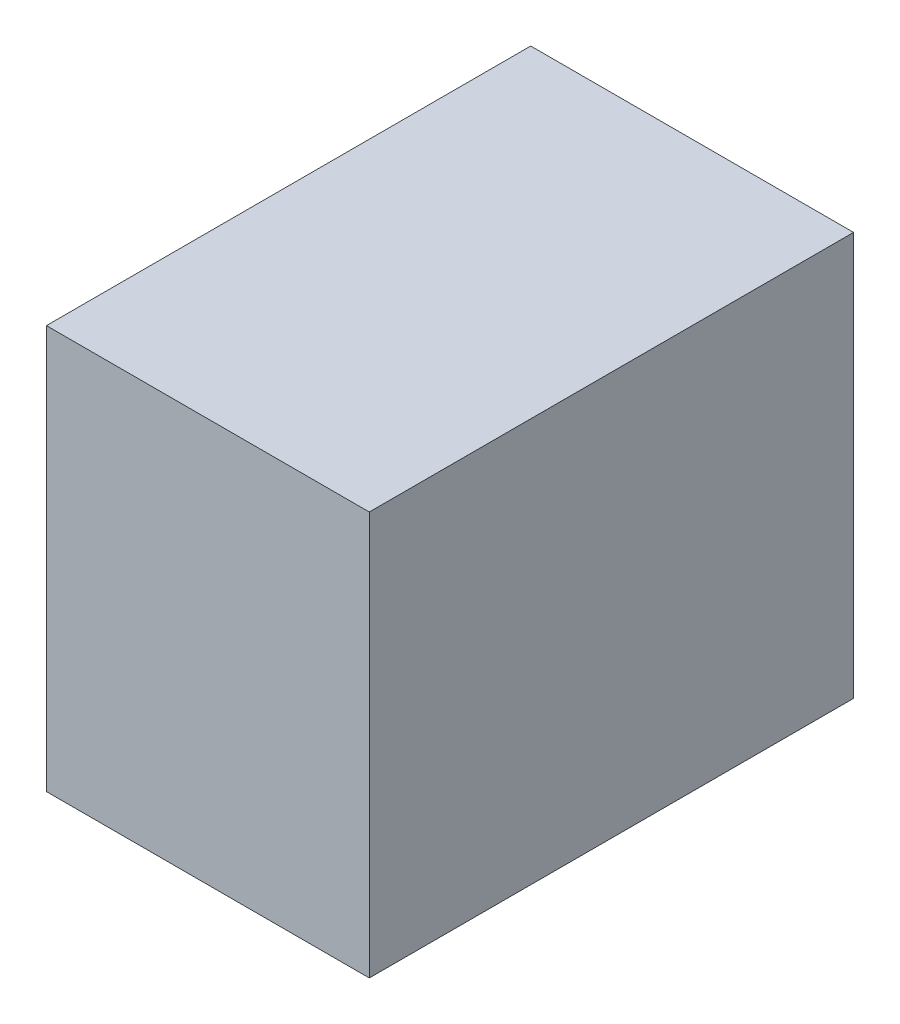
ISO-10303-21;
HEADER;
FILE_DESCRIPTION(('STEP AP214'),'2;1');
FILE_NAME('part.step','',(''),(''),'','','');
FILE_SCHEMA(('AUTOMOTIVE_DESIGN { 1 0 10303 214 1 1 1 1 }'));
ENDSEC;
DATA;
#1=APPLICATION_CONTEXT('core data for automotive mechanical design processes');
#2=APPLICATION_PROTOCOL_DEFINITION('international standard','automotive_design',2000,#1);
#3=PRODUCT_CONTEXT('',#1,'mechanical');
#4=PRODUCT('Part','Part','',(#3));
#5=PRODUCT_RELATED_PRODUCT_CATEGORY('part','',(#4));
#6=PRODUCT_DEFINITION_FORMATION('','',#4);
#7=PRODUCT_DEFINITION_CONTEXT('part definition',#1,'design');
#8=PRODUCT_DEFINITION('design','',#6,#7);
#9=PRODUCT_DEFINITION_SHAPE('','',#8);
#10=(LENGTH_UNIT() NAMED_UNIT(*) SI_UNIT(.MILLI.,.METRE.));
#11=(NAMED_UNIT(*) PLANE_ANGLE_UNIT() SI_UNIT($,.RADIAN.));
#12=(NAMED_UNIT(*) SI_UNIT($,.STERADIAN.) SOLID_ANGLE_UNIT());
#13=UNCERTAINTY_MEASURE_WITH_UNIT(LENGTH_MEASURE(1.E-05),#10,'distance_accuracy_value','');
#14=(GEOMETRIC_REPRESENTATION_CONTEXT(3) GLOBAL_UNCERTAINTY_ASSIGNED_CONTEXT((#13)) GLOBAL_UNIT_ASSIGNED_CONTEXT((#10,
#11,#12)) REPRESENTATION_CONTEXT('',''));
#15=CARTESIAN_POINT('',(0.,0.,0.));
#16=DIRECTION('',(0.,0.,1.));
#17=DIRECTION('',(1.,0.,0.));
#18=AXIS2_PLACEMENT_3D('',#15,#16,#17);
#19=CARTESIAN_POINT('',(1.270000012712E-06,0.,0.5999988));
#20=DIRECTION('',(0.,0.,-1.));
#21=DIRECTION('',(0.,-1.,0.));
#22=AXIS2_PLACEMENT_3D('',#19,#20,#21);
#23=PLANE('',#22);
#24=DIRECTION('',(0.,-1.,0.));
#25=VECTOR('',#24,1.);
#26=CARTESIAN_POINT('',(0.20000214,0.2499995,0.5999988));
#27=LINE('',#26,#25);
#28=CARTESIAN_POINT('',(0.20000214,0.2499995,0.5999988));
#29=VERTEX_POINT('',#28);
#30=CARTESIAN_POINT('',(0.20000214,-0.2499995,0.5999988));
#31=VERTEX_POINT('',#30);
#32=EDGE_CURVE('E26',#29,#31,#27,.T.);
#33=ORIENTED_EDGE('',*,*,#32,.F.);
#34=DIRECTION('',(1.,0.,0.));
#35=VECTOR('',#34,1.);
#36=CARTESIAN_POINT('',(-0.1999996,0.2499995,0.5999988));
#37=LINE('',#36,#35);
#38=CARTESIAN_POINT('',(-0.1999996,0.2499995,0.5999988));
#39=VERTEX_POINT('',#38);
#40=EDGE_CURVE('E83',#39,#29,#37,.T.);
#41=ORIENTED_EDGE('',*,*,#40,.F.);
#42=DIRECTION('',(0.,1.,0.));
#43=VECTOR('',#42,1.);
#44=CARTESIAN_POINT('',(-0.1999996,-0.2499995,0.5999988));
#45=LINE('',#44,#43);
#46=CARTESIAN_POINT('',(-0.1999996,-0.2499995,0.5999988));
#47=VERTEX_POINT('',#46);
#48=EDGE_CURVE('E91',#47,#39,#45,.T.);
#49=ORIENTED_EDGE('',*,*,#48,.F.);
#50=DIRECTION('',(-1.,0.,0.));
#51=VECTOR('',#50,1.);
#52=CARTESIAN_POINT('',(0.20000214,-0.2499995,0.5999988));
#53=LINE('',#52,#51);
#54=EDGE_CURVE('E94',#31,#47,#53,.T.);
#55=ORIENTED_EDGE('',*,*,#54,.F.);
#56=EDGE_LOOP('',(#33,#41,#49,#55));
#57=FACE_BOUND('',#56,.T.);
#58=ADVANCED_FACE('F17',(#57),#23,.F.);
#59=CARTESIAN_POINT('',(1.270000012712E-06,0.,0.));
#60=DIRECTION('',(0.,0.,-1.));
#61=DIRECTION('',(0.,-1.,0.));
#62=AXIS2_PLACEMENT_3D('',#59,#60,#61);
#63=PLANE('',#62);
#64=DIRECTION('',(-1.,0.,0.));
#65=VECTOR('',#64,1.);
#66=CARTESIAN_POINT('',(0.20000214,-0.2499995,0.));
#67=LINE('',#66,#65);
#68=CARTESIAN_POINT('',(0.20000214,-0.2499995,0.));
#69=VERTEX_POINT('',#68);
#70=CARTESIAN_POINT('',(-0.1999996,-0.2499995,0.));
#71=VERTEX_POINT('',#70);
#72=EDGE_CURVE('E86',#69,#71,#67,.T.);
#73=ORIENTED_EDGE('',*,*,#72,.T.);
#74=DIRECTION('',(0.,1.,0.));
#75=VECTOR('',#74,1.);
#76=CARTESIAN_POINT('',(-0.1999996,-0.2499995,0.));
#77=LINE('',#76,#75);
#78=CARTESIAN_POINT('',(-0.1999996,0.2499995,0.));
#79=VERTEX_POINT('',#78);
#80=EDGE_CURVE('E72',#71,#79,#77,.T.);
#81=ORIENTED_EDGE('',*,*,#80,.T.);
#82=DIRECTION('',(1.,0.,0.));
#83=VECTOR('',#82,1.);
#84=CARTESIAN_POINT('',(-0.1999996,0.2499995,0.));
#85=LINE('',#84,#83);
#86=CARTESIAN_POINT('',(0.20000214,0.2499995,0.));
#87=VERTEX_POINT('',#86);
#88=EDGE_CURVE('E20',#79,#87,#85,.T.);
#89=ORIENTED_EDGE('',*,*,#88,.T.);
#90=DIRECTION('',(0.,-1.,0.));
#91=VECTOR('',#90,1.);
#92=CARTESIAN_POINT('',(0.20000214,0.2499995,0.));
#93=LINE('',#92,#91);
#94=EDGE_CURVE('E11',#87,#69,#93,.T.);
#95=ORIENTED_EDGE('',*,*,#94,.T.);
#96=EDGE_LOOP('',(#73,#81,#89,#95));
#97=FACE_BOUND('',#96,.T.);
#98=ADVANCED_FACE('F87',(#97),#63,.T.);
#99=CARTESIAN_POINT('',(0.20000214,0.2499995,0.));
#100=DIRECTION('',(1.,0.,0.));
#101=DIRECTION('',(0.,1.,0.));
#102=AXIS2_PLACEMENT_3D('',#99,#100,#101);
#103=PLANE('',#102);
#104=DIRECTION('',(0.,0.,1.));
#105=VECTOR('',#104,1.);
#106=CARTESIAN_POINT('',(0.20000214,0.2499995,0.));
#107=LINE('',#106,#105);
#108=EDGE_CURVE('E109',#87,#29,#107,.T.);
#109=ORIENTED_EDGE('',*,*,#108,.T.);
#110=ORIENTED_EDGE('',*,*,#32,.T.);
#111=DIRECTION('',(0.,0.,1.));
#112=VECTOR('',#111,1.);
#113=CARTESIAN_POINT('',(0.20000214,-0.2499995,0.));
#114=LINE('',#113,#112);
#115=EDGE_CURVE('E101',#69,#31,#114,.T.);
#116=ORIENTED_EDGE('',*,*,#115,.F.);
#117=ORIENTED_EDGE('',*,*,#94,.F.);
#118=EDGE_LOOP('',(#109,#110,#116,#117));
#119=FACE_BOUND('',#118,.T.);
#120=ADVANCED_FACE('F176',(#119),#103,.T.);
#121=CARTESIAN_POINT('',(-0.1999996,0.2499995,0.));
#122=DIRECTION('',(0.,1.,0.));
#123=DIRECTION('',(1.,0.,0.));
#124=AXIS2_PLACEMENT_3D('',#121,#122,#123);
#125=PLANE('',#124);
#126=DIRECTION('',(0.,0.,1.));
#127=VECTOR('',#126,1.);
#128=CARTESIAN_POINT('',(-0.1999996,0.2499995,0.));
#129=LINE('',#128,#127);
#130=EDGE_CURVE('E80',#79,#39,#129,.T.);
#131=ORIENTED_EDGE('',*,*,#130,.T.);
#132=ORIENTED_EDGE('',*,*,#40,.T.);
#133=ORIENTED_EDGE('',*,*,#108,.F.);
#134=ORIENTED_EDGE('',*,*,#88,.F.);
#135=EDGE_LOOP('',(#131,#132,#133,#134));
#136=FACE_BOUND('',#135,.T.);
#137=ADVANCED_FACE('F120',(#136),#125,.T.);
#138=CARTESIAN_POINT('',(-0.1999996,-0.2499995,0.));
#139=DIRECTION('',(-1.,0.,0.));
#140=DIRECTION('',(0.,0.,1.));
#141=AXIS2_PLACEMENT_3D('',#138,#139,#140);
#142=PLANE('',#141);
#143=DIRECTION('',(0.,0.,1.));
#144=VECTOR('',#143,1.);
#145=CARTESIAN_POINT('',(-0.1999996,-0.2499995,0.));
#146=LINE('',#145,#144);
#147=EDGE_CURVE('E77',#71,#47,#146,.T.);
#148=ORIENTED_EDGE('',*,*,#147,.T.);
#149=ORIENTED_EDGE('',*,*,#48,.T.);
#150=ORIENTED_EDGE('',*,*,#130,.F.);
#151=ORIENTED_EDGE('',*,*,#80,.F.);
#152=EDGE_LOOP('',(#148,#149,#150,#151));
#153=FACE_BOUND('',#152,.T.);
#154=ADVANCED_FACE('F74',(#153),#142,.T.);
#155=CARTESIAN_POINT('',(0.20000214,-0.2499995,0.));
#156=DIRECTION('',(0.,-1.,0.));
#157=DIRECTION('',(0.,0.,-1.));
#158=AXIS2_PLACEMENT_3D('',#155,#156,#157);
#159=PLANE('',#158);
#160=ORIENTED_EDGE('',*,*,#115,.T.);
#161=ORIENTED_EDGE('',*,*,#54,.T.);
#162=ORIENTED_EDGE('',*,*,#147,.F.);
#163=ORIENTED_EDGE('',*,*,#72,.F.);
#164=EDGE_LOOP('',(#160,#161,#162,#163));
#165=FACE_BOUND('',#164,.T.);
#166=ADVANCED_FACE('F93',(#165),#159,.T.);
#167=CLOSED_SHELL('',(#58,#98,#120,#137,#154,#166));
#168=MANIFOLD_SOLID_BREP('B1',#167);
#169=ADVANCED_BREP_SHAPE_REPRESENTATION('',(#18,#168),#14);
#170=SHAPE_DEFINITION_REPRESENTATION(#9,#169);
ENDSEC;
END-ISO-10303-21;
